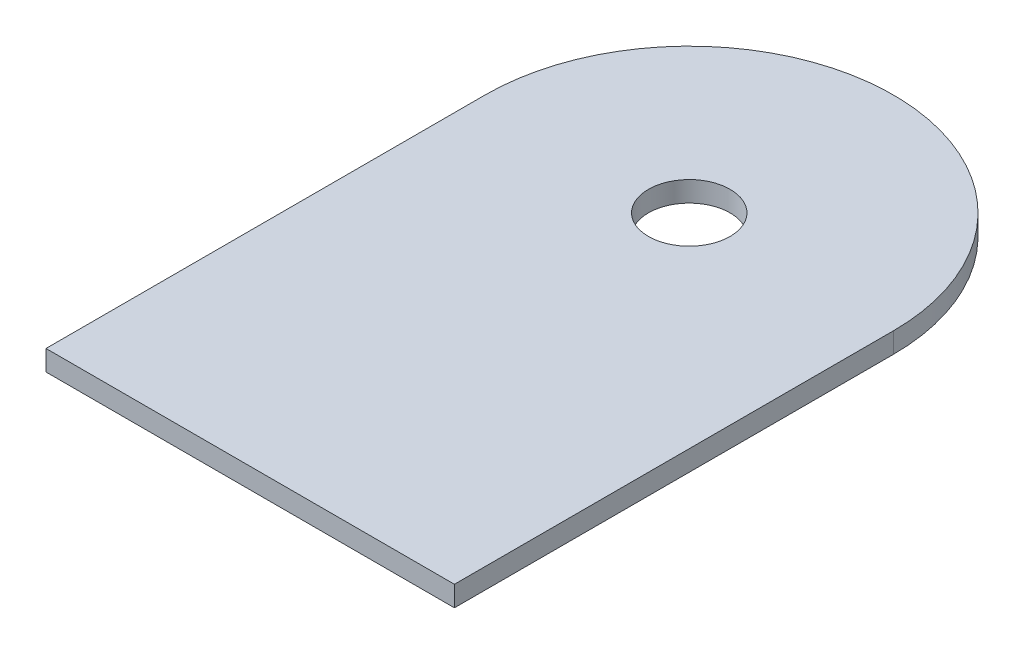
from build123d import *

# Parameters (mm, degrees)
SKETCH2_R           = 4
BOSS_EXTRUDE1_DEPTH = 2


with BuildPart() as part:
    # Sketch2 → Boss-Extrude1 (new body)
    with BuildSketch(Plane(origin=(0, 0, 0), x_dir=(1, 0, 0), z_dir=(0, 1, 0))):
        with BuildLine():
            Line((20, 0), (20, -43))
            Line((20, -43), (-20, -43))
            Line((-20, -43), (-20, 0))
            ThreePointArc((-20, 0), (0, 20), (20, 0))
        make_face()
        with Locations(Location((0, 0, 0), (0, 0, 270))):
            Circle(SKETCH2_R, mode=Mode.SUBTRACT)
    extrude(amount=BOSS_EXTRUDE1_DEPTH)


solid = part.part
